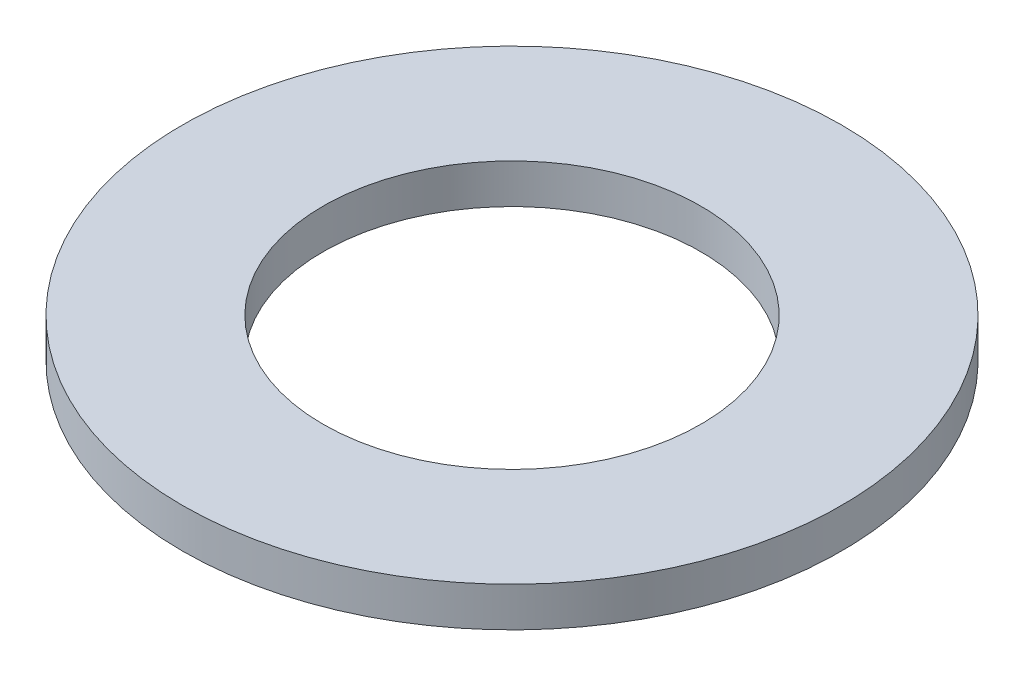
from build123d import *

# Parameters (mm, degrees)
BASESKE_R      = 3.75
BASESKE_R_2    = 2.15
BASEBODY_DEPTH = 0.45


with BuildPart() as part:
    # BaseSke → BaseBody (new body)
    with BuildSketch(Plane(origin=(0, 0, 0), x_dir=(1, 0, 0), z_dir=(0, 1, 0))):
        with Locations(Location((0, 0, 0), (0, 0, 270))):
            Circle(BASESKE_R)
        with Locations(Location((0, 0, 0), (0, 0, 270))):
            Circle(BASESKE_R_2, mode=Mode.SUBTRACT)
    extrude(amount=BASEBODY_DEPTH)


solid = part.part
